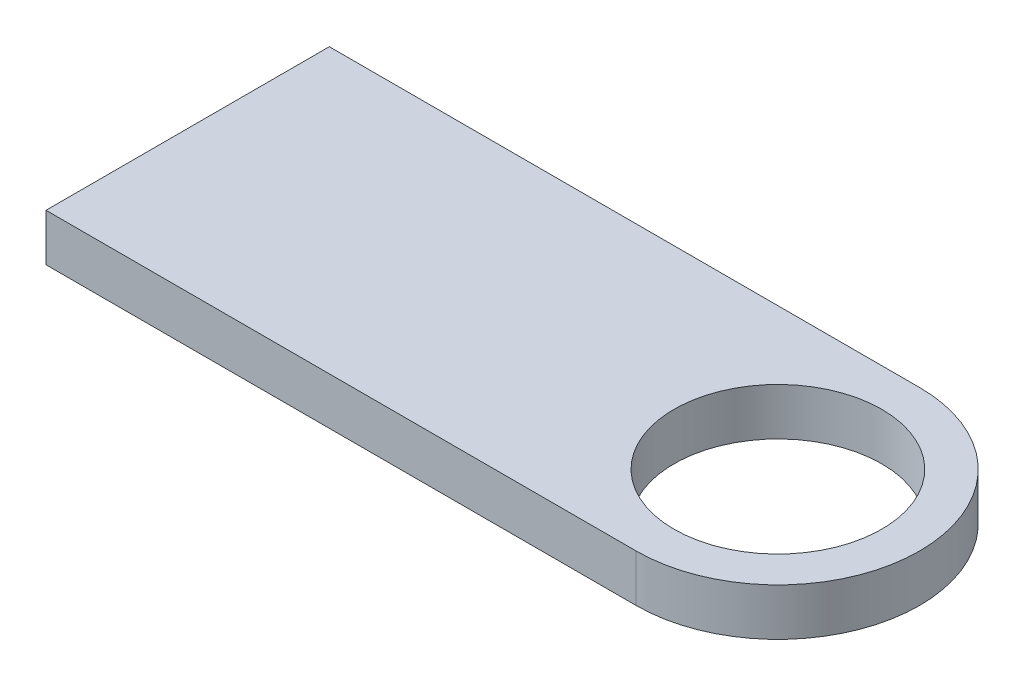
from build123d import *

# Parameters (mm, degrees)
ESQUISSE1_R        = 22
BOSS_EXTRU_1_DEPTH = 10


with BuildPart() as part:
    # Esquisse1 → Boss.-Extru.1 (new body)
    with BuildSketch(Plane(origin=(0, 5, 0), x_dir=(1, 0, 0), z_dir=(0, 1, 0))):
        with BuildLine():
            Line((0, 60), (0, 0))
            Line((0, 0), (125, 0))
            ThreePointArc((125, 0), (155, 30), (125, 60))
            Line((125, 60), (0, 60))
        make_face()
        with Locations(Location((125, 30, 0), (0, 0, 90))):
            Circle(ESQUISSE1_R, mode=Mode.SUBTRACT)
    extrude(amount=-BOSS_EXTRU_1_DEPTH)


solid = part.part
